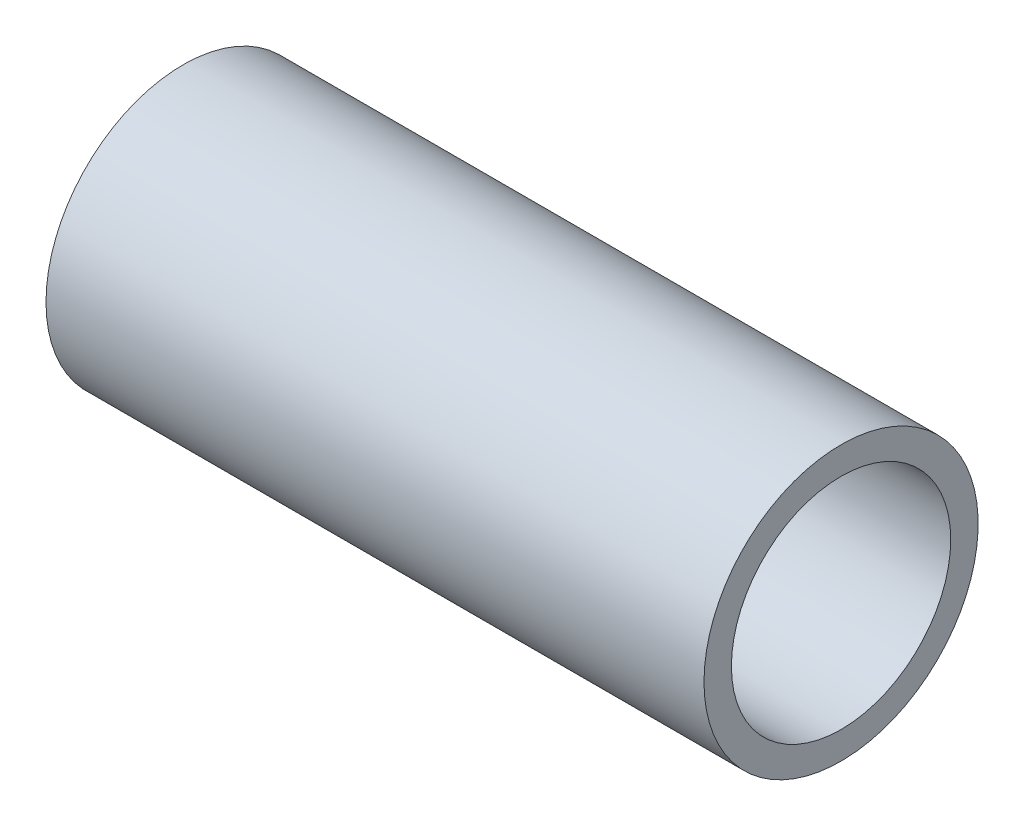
from build123d import *

# Parameters (mm, degrees)
SKETCH1_R          = 15.875
SKETCH1_R_2        = 12.7
BASE_EXTRUDE_DEPTH = 76.2


with BuildPart() as part:
    # Sketch1 → Base-Extrude (new body)
    with BuildSketch(Plane(origin=(0, 0, 0), x_dir=(0, 0, -1), z_dir=(1, 0, 0))):
        with Locations(Location((0, 0, 0), (0, 0, 180))):
            Circle(SKETCH1_R)
        with Locations(Location((0, 0, 0), (0, 0, 180))):
            Circle(SKETCH1_R_2, mode=Mode.SUBTRACT)
    extrude(amount=BASE_EXTRUDE_DEPTH)


solid = part.part
